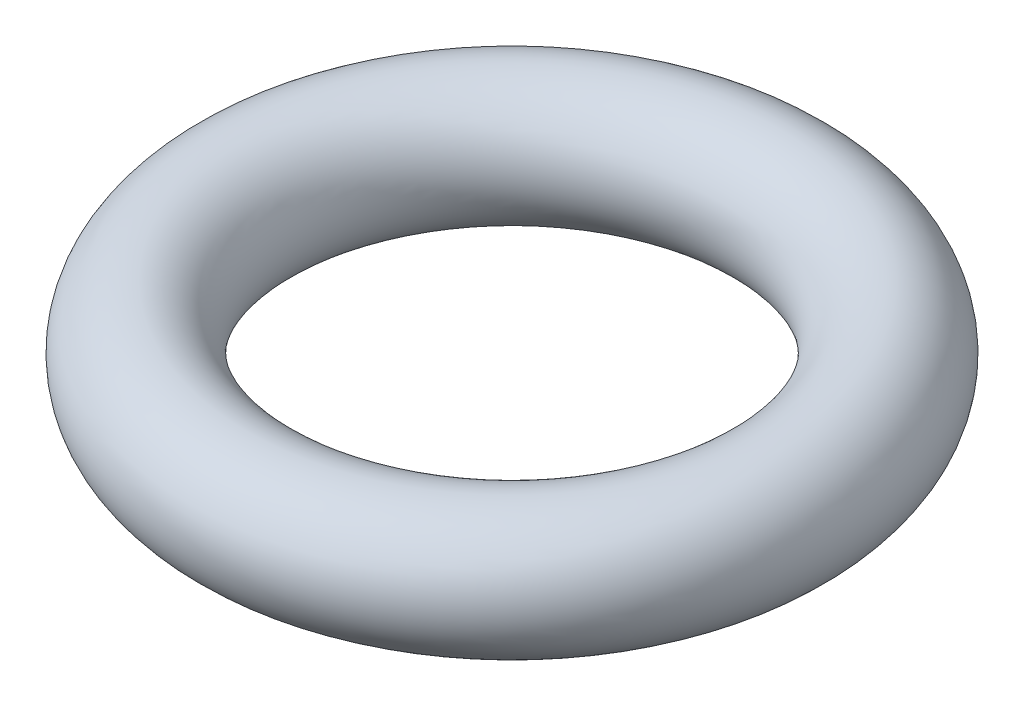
ISO-10303-21;
HEADER;
FILE_DESCRIPTION(('STEP AP214'),'2;1');
FILE_NAME('part.step','',(''),(''),'','','');
FILE_SCHEMA(('AUTOMOTIVE_DESIGN { 1 0 10303 214 1 1 1 1 }'));
ENDSEC;
DATA;
#1=APPLICATION_CONTEXT('core data for automotive mechanical design processes');
#2=APPLICATION_PROTOCOL_DEFINITION('international standard','automotive_design',2000,#1);
#3=PRODUCT_CONTEXT('',#1,'mechanical');
#4=PRODUCT('Part','Part','',(#3));
#5=PRODUCT_RELATED_PRODUCT_CATEGORY('part','',(#4));
#6=PRODUCT_DEFINITION_FORMATION('','',#4);
#7=PRODUCT_DEFINITION_CONTEXT('part definition',#1,'design');
#8=PRODUCT_DEFINITION('design','',#6,#7);
#9=PRODUCT_DEFINITION_SHAPE('','',#8);
#10=(LENGTH_UNIT() NAMED_UNIT(*) SI_UNIT(.MILLI.,.METRE.));
#11=(NAMED_UNIT(*) PLANE_ANGLE_UNIT() SI_UNIT($,.RADIAN.));
#12=(NAMED_UNIT(*) SI_UNIT($,.STERADIAN.) SOLID_ANGLE_UNIT());
#13=UNCERTAINTY_MEASURE_WITH_UNIT(LENGTH_MEASURE(1.E-05),#10,'distance_accuracy_value','');
#14=(GEOMETRIC_REPRESENTATION_CONTEXT(3) GLOBAL_UNCERTAINTY_ASSIGNED_CONTEXT((#13)) GLOBAL_UNIT_ASSIGNED_CONTEXT((#10,
#11,#12)) REPRESENTATION_CONTEXT('',''));
#15=CARTESIAN_POINT('',(0.,0.,0.));
#16=DIRECTION('',(0.,0.,1.));
#17=DIRECTION('',(1.,0.,0.));
#18=AXIS2_PLACEMENT_3D('',#15,#16,#17);
#19=CARTESIAN_POINT('',(0.,0.,0.));
#20=DIRECTION('',(0.,-1.,0.));
#21=DIRECTION('',(0.,0.,-1.));
#22=AXIS2_PLACEMENT_3D('',#19,#20,#21);
#23=TOROIDAL_SURFACE('',#22,3.35,0.800000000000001);
#24=CARTESIAN_POINT('',(0.,0.,-4.15));
#25=VERTEX_POINT('',#24);
#26=VERTEX_LOOP('',#25);
#27=FACE_BOUND('',#26,.T.);
#28=ADVANCED_FACE('F30',(#27),#23,.T.);
#29=CLOSED_SHELL('',(#28));
#30=MANIFOLD_SOLID_BREP('B2',#29);
#31=ADVANCED_BREP_SHAPE_REPRESENTATION('',(#18,#30),#14);
#32=SHAPE_DEFINITION_REPRESENTATION(#9,#31);
ENDSEC;
END-ISO-10303-21;
